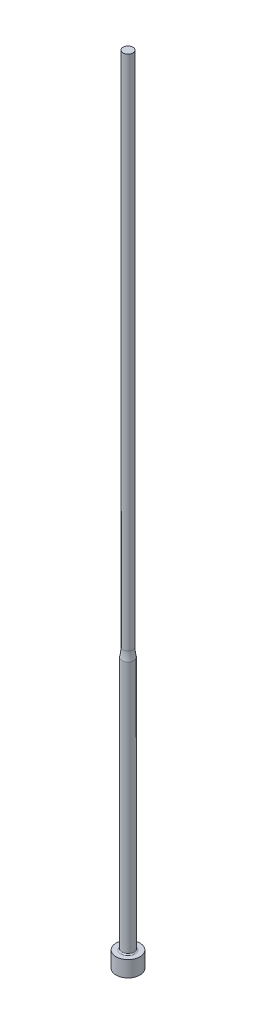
from build123d import *


with BuildPart() as part:
    # Sketch1 → Revolve1 (revolve)
    with BuildSketch(Plane.XY, mode=Mode.PRIVATE) as revolve1_sk:
        with BuildLine():
            Line((0, 0), (3, 0))
            Line((3, 0), (3, 4))
            Line((3, 4), (1.8, 4))
            ThreePointArc((1.8, 4), (1.587867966, 4.087867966), (1.5, 4.3))
            Line((1.5, 4.3), (1.5, 67.777951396))
            ThreePointArc((1.5, 67.777951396), (1.312696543, 68.881966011), (1.25, 70))
            Line((1.25, 70), (1.25, 200))
            Line((1.25, 200), (0, 200))
            Line((0, 200), (0, 0))
        make_face()
    revolve(revolve1_sk.sketch.rotate(Axis((0, 200, 0), (0, -1, 0)), 180), axis=Axis((0, 200, 0), (0, -1, 0)))


solid = part.part
